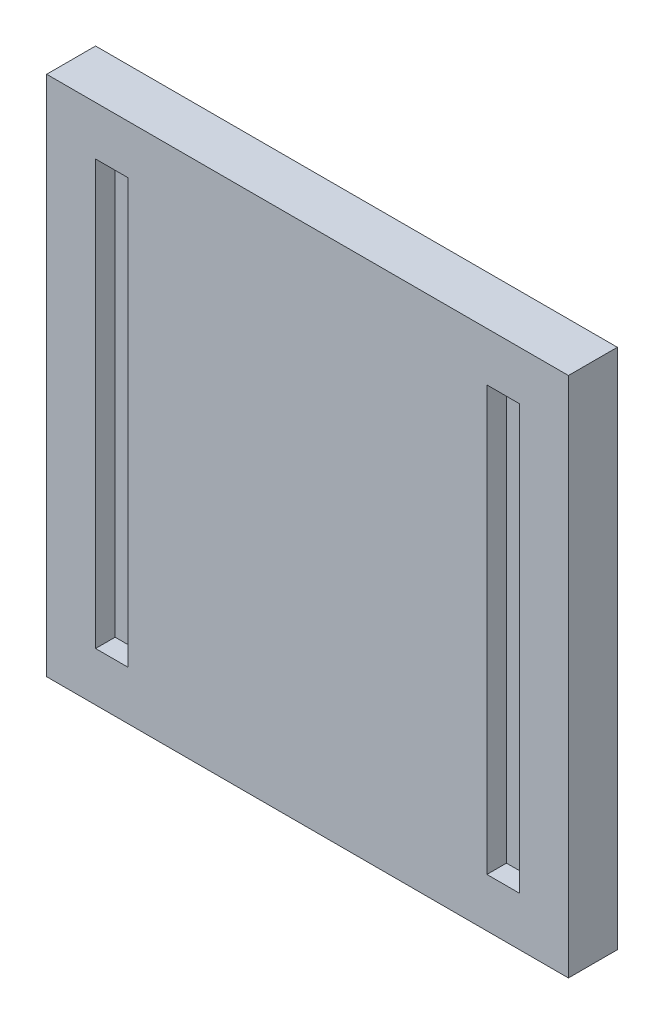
ISO-10303-21;
HEADER;
FILE_DESCRIPTION(('STEP AP214'),'2;1');
FILE_NAME('part.step','',(''),(''),'','','');
FILE_SCHEMA(('AUTOMOTIVE_DESIGN { 1 0 10303 214 1 1 1 1 }'));
ENDSEC;
DATA;
#1=APPLICATION_CONTEXT('core data for automotive mechanical design processes');
#2=APPLICATION_PROTOCOL_DEFINITION('international standard','automotive_design',2000,#1);
#3=PRODUCT_CONTEXT('',#1,'mechanical');
#4=PRODUCT('Part','Part','',(#3));
#5=PRODUCT_RELATED_PRODUCT_CATEGORY('part','',(#4));
#6=PRODUCT_DEFINITION_FORMATION('','',#4);
#7=PRODUCT_DEFINITION_CONTEXT('part definition',#1,'design');
#8=PRODUCT_DEFINITION('design','',#6,#7);
#9=PRODUCT_DEFINITION_SHAPE('','',#8);
#10=(LENGTH_UNIT() NAMED_UNIT(*) SI_UNIT(.MILLI.,.METRE.));
#11=(NAMED_UNIT(*) PLANE_ANGLE_UNIT() SI_UNIT($,.RADIAN.));
#12=(NAMED_UNIT(*) SI_UNIT($,.STERADIAN.) SOLID_ANGLE_UNIT());
#13=UNCERTAINTY_MEASURE_WITH_UNIT(LENGTH_MEASURE(1.E-05),#10,'distance_accuracy_value','');
#14=(GEOMETRIC_REPRESENTATION_CONTEXT(3) GLOBAL_UNCERTAINTY_ASSIGNED_CONTEXT((#13)) GLOBAL_UNIT_ASSIGNED_CONTEXT((#10,
#11,#12)) REPRESENTATION_CONTEXT('',''));
#15=CARTESIAN_POINT('',(0.,0.,0.));
#16=DIRECTION('',(0.,0.,1.));
#17=DIRECTION('',(1.,0.,0.));
#18=AXIS2_PLACEMENT_3D('',#15,#16,#17);
#19=CARTESIAN_POINT('',(-96.4779616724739,0.,15.));
#20=DIRECTION('',(1.,0.,0.));
#21=DIRECTION('',(0.,1.,0.));
#22=AXIS2_PLACEMENT_3D('',#19,#20,#21);
#23=PLANE('',#22);
#24=DIRECTION('',(0.,-1.,0.));
#25=VECTOR('',#24,1.);
#26=CARTESIAN_POINT('',(-96.4779616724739,0.,0.));
#27=LINE('',#26,#25);
#28=CARTESIAN_POINT('',(-96.4779616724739,0.,0.));
#29=VERTEX_POINT('',#28);
#30=CARTESIAN_POINT('',(-96.4779616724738,-160.,0.));
#31=VERTEX_POINT('',#30);
#32=EDGE_CURVE('E188',#29,#31,#27,.T.);
#33=ORIENTED_EDGE('',*,*,#32,.T.);
#34=DIRECTION('',(0.,0.,-1.));
#35=VECTOR('',#34,1.);
#36=CARTESIAN_POINT('',(-96.4779616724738,-160.,15.));
#37=LINE('',#36,#35);
#38=CARTESIAN_POINT('',(-96.4779616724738,-160.,15.));
#39=VERTEX_POINT('',#38);
#40=EDGE_CURVE('E11',#39,#31,#37,.T.);
#41=ORIENTED_EDGE('',*,*,#40,.F.);
#42=DIRECTION('',(0.,-1.,0.));
#43=VECTOR('',#42,1.);
#44=CARTESIAN_POINT('',(-96.4779616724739,0.,15.));
#45=LINE('',#44,#43);
#46=CARTESIAN_POINT('',(-96.4779616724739,0.,15.));
#47=VERTEX_POINT('',#46);
#48=EDGE_CURVE('E202',#47,#39,#45,.T.);
#49=ORIENTED_EDGE('',*,*,#48,.F.);
#50=DIRECTION('',(0.,0.,-1.));
#51=VECTOR('',#50,1.);
#52=CARTESIAN_POINT('',(-96.4779616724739,0.,15.));
#53=LINE('',#52,#51);
#54=EDGE_CURVE('E211',#47,#29,#53,.T.);
#55=ORIENTED_EDGE('',*,*,#54,.T.);
#56=EDGE_LOOP('',(#33,#41,#49,#55));
#57=FACE_BOUND('',#56,.T.);
#58=ADVANCED_FACE('F35',(#57),#23,.F.);
#59=CARTESIAN_POINT('',(-96.4779616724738,-160.,15.));
#60=DIRECTION('',(0.,1.,0.));
#61=DIRECTION('',(0.,0.,1.));
#62=AXIS2_PLACEMENT_3D('',#59,#60,#61);
#63=PLANE('',#62);
#64=DIRECTION('',(1.,0.,0.));
#65=VECTOR('',#64,1.);
#66=CARTESIAN_POINT('',(-96.4779616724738,-160.,0.));
#67=LINE('',#66,#65);
#68=CARTESIAN_POINT('',(63.5220383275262,-160.,0.));
#69=VERTEX_POINT('',#68);
#70=EDGE_CURVE('E196',#31,#69,#67,.T.);
#71=ORIENTED_EDGE('',*,*,#70,.T.);
#72=DIRECTION('',(0.,0.,-1.));
#73=VECTOR('',#72,1.);
#74=CARTESIAN_POINT('',(63.5220383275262,-160.,15.));
#75=LINE('',#74,#73);
#76=CARTESIAN_POINT('',(63.5220383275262,-160.,15.));
#77=VERTEX_POINT('',#76);
#78=EDGE_CURVE('E42',#77,#69,#75,.T.);
#79=ORIENTED_EDGE('',*,*,#78,.F.);
#80=DIRECTION('',(1.,0.,0.));
#81=VECTOR('',#80,1.);
#82=CARTESIAN_POINT('',(-96.4779616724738,-160.,15.));
#83=LINE('',#82,#81);
#84=EDGE_CURVE('E205',#39,#77,#83,.T.);
#85=ORIENTED_EDGE('',*,*,#84,.F.);
#86=ORIENTED_EDGE('',*,*,#40,.T.);
#87=EDGE_LOOP('',(#71,#79,#85,#86));
#88=FACE_BOUND('',#87,.T.);
#89=ADVANCED_FACE('F236',(#88),#63,.F.);
#90=CARTESIAN_POINT('',(63.5220383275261,0.,15.));
#91=DIRECTION('',(-1.,0.,0.));
#92=DIRECTION('',(0.,-1.,0.));
#93=AXIS2_PLACEMENT_3D('',#90,#91,#92);
#94=PLANE('',#93);
#95=DIRECTION('',(0.,1.,0.));
#96=VECTOR('',#95,1.);
#97=CARTESIAN_POINT('',(63.5220383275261,0.,0.));
#98=LINE('',#97,#96);
#99=CARTESIAN_POINT('',(63.5220383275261,0.,0.));
#100=VERTEX_POINT('',#99);
#101=EDGE_CURVE('E198',#69,#100,#98,.T.);
#102=ORIENTED_EDGE('',*,*,#101,.T.);
#103=DIRECTION('',(0.,0.,-1.));
#104=VECTOR('',#103,1.);
#105=CARTESIAN_POINT('',(63.5220383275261,0.,15.));
#106=LINE('',#105,#104);
#107=CARTESIAN_POINT('',(63.5220383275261,0.,15.));
#108=VERTEX_POINT('',#107);
#109=EDGE_CURVE('E214',#108,#100,#106,.T.);
#110=ORIENTED_EDGE('',*,*,#109,.F.);
#111=DIRECTION('',(0.,1.,0.));
#112=VECTOR('',#111,1.);
#113=CARTESIAN_POINT('',(63.5220383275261,0.,15.));
#114=LINE('',#113,#112);
#115=EDGE_CURVE('E207',#77,#108,#114,.T.);
#116=ORIENTED_EDGE('',*,*,#115,.F.);
#117=ORIENTED_EDGE('',*,*,#78,.T.);
#118=EDGE_LOOP('',(#102,#110,#116,#117));
#119=FACE_BOUND('',#118,.T.);
#120=ADVANCED_FACE('F221',(#119),#94,.F.);
#121=CARTESIAN_POINT('',(-96.4779616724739,0.,15.));
#122=DIRECTION('',(0.,-1.,0.));
#123=DIRECTION('',(1.,0.,0.));
#124=AXIS2_PLACEMENT_3D('',#121,#122,#123);
#125=PLANE('',#124);
#126=DIRECTION('',(-1.,0.,0.));
#127=VECTOR('',#126,1.);
#128=CARTESIAN_POINT('',(-96.4779616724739,0.,0.));
#129=LINE('',#128,#127);
#130=EDGE_CURVE('E200',#100,#29,#129,.T.);
#131=ORIENTED_EDGE('',*,*,#130,.T.);
#132=ORIENTED_EDGE('',*,*,#54,.F.);
#133=DIRECTION('',(-1.,0.,0.));
#134=VECTOR('',#133,1.);
#135=CARTESIAN_POINT('',(-96.4779616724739,0.,15.));
#136=LINE('',#135,#134);
#137=EDGE_CURVE('E209',#108,#47,#136,.T.);
#138=ORIENTED_EDGE('',*,*,#137,.F.);
#139=ORIENTED_EDGE('',*,*,#109,.T.);
#140=EDGE_LOOP('',(#131,#132,#138,#139));
#141=FACE_BOUND('',#140,.T.);
#142=ADVANCED_FACE('F230',(#141),#125,.F.);
#143=CARTESIAN_POINT('',(-96.4779616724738,-160.,15.));
#144=DIRECTION('',(0.,0.,1.));
#145=DIRECTION('',(1.,0.,0.));
#146=AXIS2_PLACEMENT_3D('',#143,#144,#145);
#147=PLANE('',#146);
#148=DIRECTION('',(0.,-1.,0.));
#149=VECTOR('',#148,1.);
#150=CARTESIAN_POINT('',(38.5220383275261,-15.,15.));
#151=LINE('',#150,#149);
#152=CARTESIAN_POINT('',(38.5220383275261,-15.,15.));
#153=VERTEX_POINT('',#152);
#154=CARTESIAN_POINT('',(38.5220383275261,-145.,15.));
#155=VERTEX_POINT('',#154);
#156=EDGE_CURVE('E49',#153,#155,#151,.T.);
#157=ORIENTED_EDGE('',*,*,#156,.F.);
#158=DIRECTION('',(-1.,0.,0.));
#159=VECTOR('',#158,1.);
#160=CARTESIAN_POINT('',(38.5220383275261,-15.,15.));
#161=LINE('',#160,#159);
#162=CARTESIAN_POINT('',(48.5220383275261,-15.,15.));
#163=VERTEX_POINT('',#162);
#164=EDGE_CURVE('E145',#163,#153,#161,.T.);
#165=ORIENTED_EDGE('',*,*,#164,.F.);
#166=DIRECTION('',(0.,1.,0.));
#167=VECTOR('',#166,1.);
#168=CARTESIAN_POINT('',(48.5220383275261,-15.,15.));
#169=LINE('',#168,#167);
#170=CARTESIAN_POINT('',(48.5220383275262,-145.,15.));
#171=VERTEX_POINT('',#170);
#172=EDGE_CURVE('E127',#171,#163,#169,.T.);
#173=ORIENTED_EDGE('',*,*,#172,.F.);
#174=DIRECTION('',(1.,0.,0.));
#175=VECTOR('',#174,1.);
#176=CARTESIAN_POINT('',(38.5220383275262,-145.,15.));
#177=LINE('',#176,#175);
#178=EDGE_CURVE('E138',#155,#171,#177,.T.);
#179=ORIENTED_EDGE('',*,*,#178,.F.);
#180=EDGE_LOOP('',(#157,#165,#173,#179));
#181=FACE_BOUND('',#180,.T.);
#182=DIRECTION('',(0.,-1.,0.));
#183=VECTOR('',#182,1.);
#184=CARTESIAN_POINT('',(-81.4779616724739,-15.,15.));
#185=LINE('',#184,#183);
#186=CARTESIAN_POINT('',(-81.4779616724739,-15.,15.));
#187=VERTEX_POINT('',#186);
#188=CARTESIAN_POINT('',(-81.4779616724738,-145.,15.));
#189=VERTEX_POINT('',#188);
#190=EDGE_CURVE('E57',#187,#189,#185,.T.);
#191=ORIENTED_EDGE('',*,*,#190,.F.);
#192=DIRECTION('',(-1.,0.,0.));
#193=VECTOR('',#192,1.);
#194=CARTESIAN_POINT('',(-81.4779616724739,-15.,15.));
#195=LINE('',#194,#193);
#196=CARTESIAN_POINT('',(-71.4779616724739,-15.,15.));
#197=VERTEX_POINT('',#196);
#198=EDGE_CURVE('E170',#197,#187,#195,.T.);
#199=ORIENTED_EDGE('',*,*,#198,.F.);
#200=DIRECTION('',(0.,1.,0.));
#201=VECTOR('',#200,1.);
#202=CARTESIAN_POINT('',(-71.4779616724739,-15.,15.));
#203=LINE('',#202,#201);
#204=CARTESIAN_POINT('',(-71.4779616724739,-145.,15.));
#205=VERTEX_POINT('',#204);
#206=EDGE_CURVE('E167',#205,#197,#203,.T.);
#207=ORIENTED_EDGE('',*,*,#206,.F.);
#208=DIRECTION('',(1.,0.,0.));
#209=VECTOR('',#208,1.);
#210=CARTESIAN_POINT('',(-81.4779616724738,-145.,15.));
#211=LINE('',#210,#209);
#212=EDGE_CURVE('E164',#189,#205,#211,.T.);
#213=ORIENTED_EDGE('',*,*,#212,.F.);
#214=EDGE_LOOP('',(#191,#199,#207,#213));
#215=FACE_BOUND('',#214,.T.);
#216=ORIENTED_EDGE('',*,*,#48,.T.);
#217=ORIENTED_EDGE('',*,*,#84,.T.);
#218=ORIENTED_EDGE('',*,*,#115,.T.);
#219=ORIENTED_EDGE('',*,*,#137,.T.);
#220=EDGE_LOOP('',(#216,#217,#218,#219));
#221=FACE_BOUND('',#220,.T.);
#222=ADVANCED_FACE('F142',(#181,#215,#221),#147,.T.);
#223=CARTESIAN_POINT('',(-96.4779616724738,-160.,0.));
#224=DIRECTION('',(0.,0.,1.));
#225=DIRECTION('',(1.,0.,0.));
#226=AXIS2_PLACEMENT_3D('',#223,#224,#225);
#227=PLANE('',#226);
#228=ORIENTED_EDGE('',*,*,#32,.F.);
#229=ORIENTED_EDGE('',*,*,#130,.F.);
#230=ORIENTED_EDGE('',*,*,#101,.F.);
#231=ORIENTED_EDGE('',*,*,#70,.F.);
#232=EDGE_LOOP('',(#228,#229,#230,#231));
#233=FACE_BOUND('',#232,.T.);
#234=ADVANCED_FACE('F227',(#233),#227,.F.);
#235=CARTESIAN_POINT('',(-81.4779616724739,-15.,9.));
#236=DIRECTION('',(-1.,0.,0.));
#237=DIRECTION('',(0.,-1.,0.));
#238=AXIS2_PLACEMENT_3D('',#235,#236,#237);
#239=PLANE('',#238);
#240=ORIENTED_EDGE('',*,*,#190,.T.);
#241=DIRECTION('',(0.,0.,1.));
#242=VECTOR('',#241,1.);
#243=CARTESIAN_POINT('',(-81.4779616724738,-145.,9.));
#244=LINE('',#243,#242);
#245=CARTESIAN_POINT('',(-81.4779616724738,-145.,9.));
#246=VERTEX_POINT('',#245);
#247=EDGE_CURVE('E185',#246,#189,#244,.T.);
#248=ORIENTED_EDGE('',*,*,#247,.F.);
#249=DIRECTION('',(0.,-1.,0.));
#250=VECTOR('',#249,1.);
#251=CARTESIAN_POINT('',(-81.4779616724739,-15.,9.));
#252=LINE('',#251,#250);
#253=CARTESIAN_POINT('',(-81.4779616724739,-15.,9.));
#254=VERTEX_POINT('',#253);
#255=EDGE_CURVE('E173',#254,#246,#252,.T.);
#256=ORIENTED_EDGE('',*,*,#255,.F.);
#257=DIRECTION('',(0.,0.,1.));
#258=VECTOR('',#257,1.);
#259=CARTESIAN_POINT('',(-81.4779616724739,-15.,9.));
#260=LINE('',#259,#258);
#261=EDGE_CURVE('E186',#254,#187,#260,.T.);
#262=ORIENTED_EDGE('',*,*,#261,.T.);
#263=EDGE_LOOP('',(#240,#248,#256,#262));
#264=FACE_BOUND('',#263,.T.);
#265=ADVANCED_FACE('F250',(#264),#239,.F.);
#266=CARTESIAN_POINT('',(-81.4779616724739,-15.,9.));
#267=DIRECTION('',(0.,1.,0.));
#268=DIRECTION('',(0.,0.,1.));
#269=AXIS2_PLACEMENT_3D('',#266,#267,#268);
#270=PLANE('',#269);
#271=ORIENTED_EDGE('',*,*,#198,.T.);
#272=ORIENTED_EDGE('',*,*,#261,.F.);
#273=DIRECTION('',(-1.,0.,0.));
#274=VECTOR('',#273,1.);
#275=CARTESIAN_POINT('',(-81.4779616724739,-15.,9.));
#276=LINE('',#275,#274);
#277=CARTESIAN_POINT('',(-71.4779616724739,-15.,9.));
#278=VERTEX_POINT('',#277);
#279=EDGE_CURVE('E182',#278,#254,#276,.T.);
#280=ORIENTED_EDGE('',*,*,#279,.F.);
#281=DIRECTION('',(0.,0.,1.));
#282=VECTOR('',#281,1.);
#283=CARTESIAN_POINT('',(-71.4779616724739,-15.,9.));
#284=LINE('',#283,#282);
#285=EDGE_CURVE('E189',#278,#197,#284,.T.);
#286=ORIENTED_EDGE('',*,*,#285,.T.);
#287=EDGE_LOOP('',(#271,#272,#280,#286));
#288=FACE_BOUND('',#287,.T.);
#289=ADVANCED_FACE('F253',(#288),#270,.F.);
#290=CARTESIAN_POINT('',(-71.4779616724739,-15.,9.));
#291=DIRECTION('',(1.,0.,0.));
#292=DIRECTION('',(0.,1.,0.));
#293=AXIS2_PLACEMENT_3D('',#290,#291,#292);
#294=PLANE('',#293);
#295=ORIENTED_EDGE('',*,*,#206,.T.);
#296=ORIENTED_EDGE('',*,*,#285,.F.);
#297=DIRECTION('',(0.,1.,0.));
#298=VECTOR('',#297,1.);
#299=CARTESIAN_POINT('',(-71.4779616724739,-15.,9.));
#300=LINE('',#299,#298);
#301=CARTESIAN_POINT('',(-71.4779616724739,-145.,9.));
#302=VERTEX_POINT('',#301);
#303=EDGE_CURVE('E179',#302,#278,#300,.T.);
#304=ORIENTED_EDGE('',*,*,#303,.F.);
#305=DIRECTION('',(0.,0.,1.));
#306=VECTOR('',#305,1.);
#307=CARTESIAN_POINT('',(-71.4779616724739,-145.,9.));
#308=LINE('',#307,#306);
#309=EDGE_CURVE('E191',#302,#205,#308,.T.);
#310=ORIENTED_EDGE('',*,*,#309,.T.);
#311=EDGE_LOOP('',(#295,#296,#304,#310));
#312=FACE_BOUND('',#311,.T.);
#313=ADVANCED_FACE('F258',(#312),#294,.F.);
#314=CARTESIAN_POINT('',(-81.4779616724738,-145.,9.));
#315=DIRECTION('',(0.,-1.,0.));
#316=DIRECTION('',(0.,0.,-1.));
#317=AXIS2_PLACEMENT_3D('',#314,#315,#316);
#318=PLANE('',#317);
#319=ORIENTED_EDGE('',*,*,#212,.T.);
#320=ORIENTED_EDGE('',*,*,#309,.F.);
#321=DIRECTION('',(1.,0.,0.));
#322=VECTOR('',#321,1.);
#323=CARTESIAN_POINT('',(-81.4779616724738,-145.,9.));
#324=LINE('',#323,#322);
#325=EDGE_CURVE('E176',#246,#302,#324,.T.);
#326=ORIENTED_EDGE('',*,*,#325,.F.);
#327=ORIENTED_EDGE('',*,*,#247,.T.);
#328=EDGE_LOOP('',(#319,#320,#326,#327));
#329=FACE_BOUND('',#328,.T.);
#330=ADVANCED_FACE('F254',(#329),#318,.F.);
#331=CARTESIAN_POINT('',(-81.4779616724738,-145.,9.));
#332=DIRECTION('',(0.,0.,1.));
#333=DIRECTION('',(1.,0.,0.));
#334=AXIS2_PLACEMENT_3D('',#331,#332,#333);
#335=PLANE('',#334);
#336=ORIENTED_EDGE('',*,*,#255,.T.);
#337=ORIENTED_EDGE('',*,*,#325,.T.);
#338=ORIENTED_EDGE('',*,*,#303,.T.);
#339=ORIENTED_EDGE('',*,*,#279,.T.);
#340=EDGE_LOOP('',(#336,#337,#338,#339));
#341=FACE_BOUND('',#340,.T.);
#342=ADVANCED_FACE('F257',(#341),#335,.T.);
#343=CARTESIAN_POINT('',(38.5220383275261,-15.,9.));
#344=DIRECTION('',(-1.,0.,0.));
#345=DIRECTION('',(0.,-1.,0.));
#346=AXIS2_PLACEMENT_3D('',#343,#344,#345);
#347=PLANE('',#346);
#348=ORIENTED_EDGE('',*,*,#156,.T.);
#349=DIRECTION('',(0.,0.,1.));
#350=VECTOR('',#349,1.);
#351=CARTESIAN_POINT('',(38.5220383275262,-145.,9.));
#352=LINE('',#351,#350);
#353=CARTESIAN_POINT('',(38.5220383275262,-145.,9.));
#354=VERTEX_POINT('',#353);
#355=EDGE_CURVE('E135',#354,#155,#352,.T.);
#356=ORIENTED_EDGE('',*,*,#355,.F.);
#357=DIRECTION('',(0.,-1.,0.));
#358=VECTOR('',#357,1.);
#359=CARTESIAN_POINT('',(38.5220383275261,-15.,9.));
#360=LINE('',#359,#358);
#361=CARTESIAN_POINT('',(38.5220383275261,-15.,9.));
#362=VERTEX_POINT('',#361);
#363=EDGE_CURVE('E147',#362,#354,#360,.T.);
#364=ORIENTED_EDGE('',*,*,#363,.F.);
#365=DIRECTION('',(0.,0.,1.));
#366=VECTOR('',#365,1.);
#367=CARTESIAN_POINT('',(38.5220383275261,-15.,9.));
#368=LINE('',#367,#366);
#369=EDGE_CURVE('E159',#362,#153,#368,.T.);
#370=ORIENTED_EDGE('',*,*,#369,.T.);
#371=EDGE_LOOP('',(#348,#356,#364,#370));
#372=FACE_BOUND('',#371,.T.);
#373=ADVANCED_FACE('F268',(#372),#347,.F.);
#374=CARTESIAN_POINT('',(38.5220383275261,-15.,9.));
#375=DIRECTION('',(0.,1.,0.));
#376=DIRECTION('',(0.,0.,1.));
#377=AXIS2_PLACEMENT_3D('',#374,#375,#376);
#378=PLANE('',#377);
#379=ORIENTED_EDGE('',*,*,#164,.T.);
#380=ORIENTED_EDGE('',*,*,#369,.F.);
#381=DIRECTION('',(-1.,0.,0.));
#382=VECTOR('',#381,1.);
#383=CARTESIAN_POINT('',(38.5220383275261,-15.,9.));
#384=LINE('',#383,#382);
#385=CARTESIAN_POINT('',(48.5220383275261,-15.,9.));
#386=VERTEX_POINT('',#385);
#387=EDGE_CURVE('E156',#386,#362,#384,.T.);
#388=ORIENTED_EDGE('',*,*,#387,.F.);
#389=DIRECTION('',(0.,0.,1.));
#390=VECTOR('',#389,1.);
#391=CARTESIAN_POINT('',(48.5220383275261,-15.,9.));
#392=LINE('',#391,#390);
#393=EDGE_CURVE('E134',#386,#163,#392,.T.);
#394=ORIENTED_EDGE('',*,*,#393,.T.);
#395=EDGE_LOOP('',(#379,#380,#388,#394));
#396=FACE_BOUND('',#395,.T.);
#397=ADVANCED_FACE('F272',(#396),#378,.F.);
#398=CARTESIAN_POINT('',(48.5220383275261,-15.,9.));
#399=DIRECTION('',(1.,0.,0.));
#400=DIRECTION('',(0.,1.,0.));
#401=AXIS2_PLACEMENT_3D('',#398,#399,#400);
#402=PLANE('',#401);
#403=ORIENTED_EDGE('',*,*,#172,.T.);
#404=ORIENTED_EDGE('',*,*,#393,.F.);
#405=DIRECTION('',(0.,1.,0.));
#406=VECTOR('',#405,1.);
#407=CARTESIAN_POINT('',(48.5220383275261,-15.,9.));
#408=LINE('',#407,#406);
#409=CARTESIAN_POINT('',(48.5220383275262,-145.,9.));
#410=VERTEX_POINT('',#409);
#411=EDGE_CURVE('E130',#410,#386,#408,.T.);
#412=ORIENTED_EDGE('',*,*,#411,.F.);
#413=DIRECTION('',(0.,0.,1.));
#414=VECTOR('',#413,1.);
#415=CARTESIAN_POINT('',(48.5220383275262,-145.,9.));
#416=LINE('',#415,#414);
#417=EDGE_CURVE('E123',#410,#171,#416,.T.);
#418=ORIENTED_EDGE('',*,*,#417,.T.);
#419=EDGE_LOOP('',(#403,#404,#412,#418));
#420=FACE_BOUND('',#419,.T.);
#421=ADVANCED_FACE('F125',(#420),#402,.F.);
#422=CARTESIAN_POINT('',(38.5220383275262,-145.,9.));
#423=DIRECTION('',(0.,-1.,0.));
#424=DIRECTION('',(0.,0.,-1.));
#425=AXIS2_PLACEMENT_3D('',#422,#423,#424);
#426=PLANE('',#425);
#427=ORIENTED_EDGE('',*,*,#178,.T.);
#428=ORIENTED_EDGE('',*,*,#417,.F.);
#429=DIRECTION('',(1.,0.,0.));
#430=VECTOR('',#429,1.);
#431=CARTESIAN_POINT('',(38.5220383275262,-145.,9.));
#432=LINE('',#431,#430);
#433=EDGE_CURVE('E153',#354,#410,#432,.T.);
#434=ORIENTED_EDGE('',*,*,#433,.F.);
#435=ORIENTED_EDGE('',*,*,#355,.T.);
#436=EDGE_LOOP('',(#427,#428,#434,#435));
#437=FACE_BOUND('',#436,.T.);
#438=ADVANCED_FACE('F139',(#437),#426,.F.);
#439=CARTESIAN_POINT('',(38.5220383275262,-145.,9.));
#440=DIRECTION('',(0.,0.,1.));
#441=DIRECTION('',(1.,0.,0.));
#442=AXIS2_PLACEMENT_3D('',#439,#440,#441);
#443=PLANE('',#442);
#444=ORIENTED_EDGE('',*,*,#363,.T.);
#445=ORIENTED_EDGE('',*,*,#433,.T.);
#446=ORIENTED_EDGE('',*,*,#411,.T.);
#447=ORIENTED_EDGE('',*,*,#387,.T.);
#448=EDGE_LOOP('',(#444,#445,#446,#447));
#449=FACE_BOUND('',#448,.T.);
#450=ADVANCED_FACE('F275',(#449),#443,.T.);
#451=CLOSED_SHELL('',(#58,#89,#120,#142,#222,#234,#265,#289,#313,#330,#342,#373,#397,#421,#438,#450));
#452=MANIFOLD_SOLID_BREP('B2',#451);
#453=ADVANCED_BREP_SHAPE_REPRESENTATION('',(#18,#452),#14);
#454=SHAPE_DEFINITION_REPRESENTATION(#9,#453);
ENDSEC;
END-ISO-10303-21;
